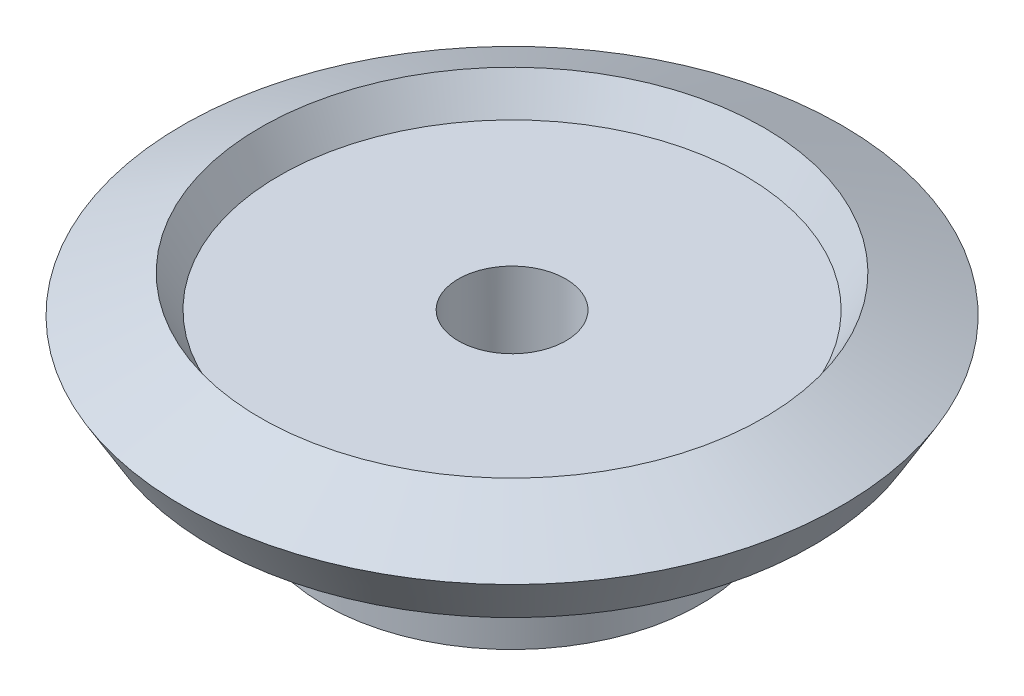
from build123d import *

# Parameters (mm, degrees)
ESQUISSE2_W                  = 1.65
ESQUISSE2_H                  = 41.895999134
R_P_TITION_CIRCULAIRE1_COUNT = 3


with BuildPart() as part:
    # Esquisse1 → R_volution1 (revolve)
    with BuildSketch(Plane.XY, mode=Mode.PRIVATE) as r_volution1_sk:
        Polygon((5, 0), (17.5, 0), (17.5, 10), (28, 10), (30.67, 14.55235), (23.417620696, 18), (21.658089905, 15), (5, 15), align=None)
    revolve(r_volution1_sk.sketch.rotate(Axis((0, 0, 0), (0, 1, 0)), 90), axis=Axis((0, 0, 0), (0, 1, 0)))

    # Esquisse2 → Trou taraud_ M4x0.71 (revolve, cut)
    with BuildSketch(Plane(origin=(0, 6, 0), x_dir=(0, 1, 0), z_dir=(1, 0, 0))):
        with Locations((0.825, 20.947999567)):
            Rectangle(ESQUISSE2_W, ESQUISSE2_H)
    trou_taraud_m4x0_71 = revolve(axis=Axis((0, 6, -6.35), (0, 0, 1)), mode=Mode.SUBTRACT)

    # R_p_tition circulaire1: Trou taraud_ M4x0.71 ×3 about axis
    r_p_tition_circulaire1_axis = Axis((0, 0, 0), (0, 1, 0))
    for i in range(1, R_P_TITION_CIRCULAIRE1_COUNT):
        add(trou_taraud_m4x0_71.rotate(r_p_tition_circulaire1_axis, i * 360 / R_P_TITION_CIRCULAIRE1_COUNT), mode=Mode.SUBTRACT)


solid = part.part
